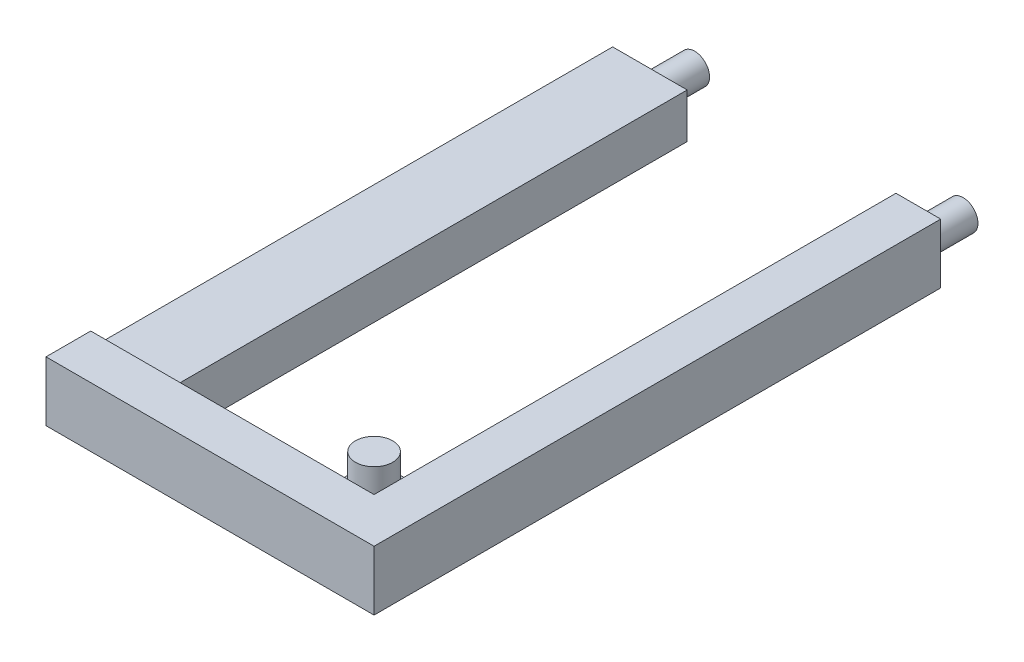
ISO-10303-21;
HEADER;
FILE_DESCRIPTION(('STEP AP214'),'2;1');
FILE_NAME('part.step','',(''),(''),'','','');
FILE_SCHEMA(('AUTOMOTIVE_DESIGN { 1 0 10303 214 1 1 1 1 }'));
ENDSEC;
DATA;
#1=APPLICATION_CONTEXT('core data for automotive mechanical design processes');
#2=APPLICATION_PROTOCOL_DEFINITION('international standard','automotive_design',2000,#1);
#3=PRODUCT_CONTEXT('',#1,'mechanical');
#4=PRODUCT('Part','Part','',(#3));
#5=PRODUCT_RELATED_PRODUCT_CATEGORY('part','',(#4));
#6=PRODUCT_DEFINITION_FORMATION('','',#4);
#7=PRODUCT_DEFINITION_CONTEXT('part definition',#1,'design');
#8=PRODUCT_DEFINITION('design','',#6,#7);
#9=PRODUCT_DEFINITION_SHAPE('','',#8);
#10=(LENGTH_UNIT() NAMED_UNIT(*) SI_UNIT(.MILLI.,.METRE.));
#11=(NAMED_UNIT(*) PLANE_ANGLE_UNIT() SI_UNIT($,.RADIAN.));
#12=(NAMED_UNIT(*) SI_UNIT($,.STERADIAN.) SOLID_ANGLE_UNIT());
#13=UNCERTAINTY_MEASURE_WITH_UNIT(LENGTH_MEASURE(1.E-05),#10,'distance_accuracy_value','');
#14=(GEOMETRIC_REPRESENTATION_CONTEXT(3) GLOBAL_UNCERTAINTY_ASSIGNED_CONTEXT((#13)) GLOBAL_UNIT_ASSIGNED_CONTEXT((#10,
#11,#12)) REPRESENTATION_CONTEXT('',''));
#15=CARTESIAN_POINT('',(0.,0.,0.));
#16=DIRECTION('',(0.,0.,1.));
#17=DIRECTION('',(1.,0.,0.));
#18=AXIS2_PLACEMENT_3D('',#15,#16,#17);
#19=CARTESIAN_POINT('',(2.5,3.,17.5));
#20=DIRECTION('',(-1.,0.,0.));
#21=DIRECTION('',(0.,0.,1.));
#22=AXIS2_PLACEMENT_3D('',#19,#20,#21);
#23=PLANE('',#22);
#24=DIRECTION('',(0.,0.,-1.));
#25=VECTOR('',#24,1.);
#26=CARTESIAN_POINT('',(2.5,0.,17.5));
#27=LINE('',#26,#25);
#28=CARTESIAN_POINT('',(2.5,0.,17.5));
#29=VERTEX_POINT('',#28);
#30=CARTESIAN_POINT('',(2.5,0.,-17.5));
#31=VERTEX_POINT('',#30);
#32=EDGE_CURVE('E108',#29,#31,#27,.T.);
#33=ORIENTED_EDGE('',*,*,#32,.T.);
#34=DIRECTION('',(0.,-1.,0.));
#35=VECTOR('',#34,1.);
#36=CARTESIAN_POINT('',(2.5,3.,-17.5));
#37=LINE('',#36,#35);
#38=CARTESIAN_POINT('',(2.5,3.,-17.5));
#39=VERTEX_POINT('',#38);
#40=EDGE_CURVE('E90',#39,#31,#37,.T.);
#41=ORIENTED_EDGE('',*,*,#40,.F.);
#42=DIRECTION('',(0.,0.,-1.));
#43=VECTOR('',#42,1.);
#44=CARTESIAN_POINT('',(2.5,3.,17.5));
#45=LINE('',#44,#43);
#46=CARTESIAN_POINT('',(2.5,3.,17.5));
#47=VERTEX_POINT('',#46);
#48=EDGE_CURVE('E99',#47,#39,#45,.T.);
#49=ORIENTED_EDGE('',*,*,#48,.F.);
#50=DIRECTION('',(0.,-1.,0.));
#51=VECTOR('',#50,1.);
#52=CARTESIAN_POINT('',(2.5,3.,17.5));
#53=LINE('',#52,#51);
#54=EDGE_CURVE('E60',#47,#29,#53,.T.);
#55=ORIENTED_EDGE('',*,*,#54,.T.);
#56=EDGE_LOOP('',(#33,#41,#49,#55));
#57=FACE_BOUND('',#56,.T.);
#58=ADVANCED_FACE('F43',(#57),#23,.F.);
#59=CARTESIAN_POINT('',(-2.5,3.,-17.5));
#60=DIRECTION('',(0.,0.,1.));
#61=DIRECTION('',(1.,0.,0.));
#62=AXIS2_PLACEMENT_3D('',#59,#60,#61);
#63=PLANE('',#62);
#64=CARTESIAN_POINT('',(0.,1.5,-17.5));
#65=DIRECTION('',(0.,0.,1.));
#66=DIRECTION('',(1.,0.,0.));
#67=AXIS2_PLACEMENT_3D('',#64,#65,#66);
#68=CIRCLE('',#67,1.);
#69=CARTESIAN_POINT('',(1.,1.5,-17.5));
#70=VERTEX_POINT('',#69);
#71=EDGE_CURVE('E11',#70,#70,#68,.F.);
#72=ORIENTED_EDGE('',*,*,#71,.F.);
#73=EDGE_LOOP('',(#72));
#74=FACE_BOUND('',#73,.T.);
#75=DIRECTION('',(-1.,0.,0.));
#76=VECTOR('',#75,1.);
#77=CARTESIAN_POINT('',(-2.5,0.,-17.5));
#78=LINE('',#77,#76);
#79=CARTESIAN_POINT('',(-2.5,0.,-17.5));
#80=VERTEX_POINT('',#79);
#81=EDGE_CURVE('E73',#31,#80,#78,.T.);
#82=ORIENTED_EDGE('',*,*,#81,.T.);
#83=DIRECTION('',(0.,-1.,0.));
#84=VECTOR('',#83,1.);
#85=CARTESIAN_POINT('',(-2.5,3.,-17.5));
#86=LINE('',#85,#84);
#87=CARTESIAN_POINT('',(-2.5,3.,-17.5));
#88=VERTEX_POINT('',#87);
#89=EDGE_CURVE('E93',#88,#80,#86,.T.);
#90=ORIENTED_EDGE('',*,*,#89,.F.);
#91=DIRECTION('',(-1.,0.,0.));
#92=VECTOR('',#91,1.);
#93=CARTESIAN_POINT('',(-2.5,3.,-17.5));
#94=LINE('',#93,#92);
#95=EDGE_CURVE('E86',#39,#88,#94,.T.);
#96=ORIENTED_EDGE('',*,*,#95,.F.);
#97=ORIENTED_EDGE('',*,*,#40,.T.);
#98=EDGE_LOOP('',(#82,#90,#96,#97));
#99=FACE_BOUND('',#98,.T.);
#100=ADVANCED_FACE('F88',(#74,#99),#63,.F.);
#101=CARTESIAN_POINT('',(-2.5,3.,17.5));
#102=DIRECTION('',(1.,0.,0.));
#103=DIRECTION('',(0.,0.,-1.));
#104=AXIS2_PLACEMENT_3D('',#101,#102,#103);
#105=PLANE('',#104);
#106=DIRECTION('',(0.,0.,1.));
#107=VECTOR('',#106,1.);
#108=CARTESIAN_POINT('',(-2.5,0.,17.5));
#109=LINE('',#108,#107);
#110=CARTESIAN_POINT('',(-2.5,0.,20.5));
#111=VERTEX_POINT('',#110);
#112=EDGE_CURVE('E106',#80,#111,#109,.T.);
#113=ORIENTED_EDGE('',*,*,#112,.T.);
#114=DIRECTION('',(0.,-1.,0.));
#115=VECTOR('',#114,1.);
#116=CARTESIAN_POINT('',(-2.5,0.,20.5));
#117=LINE('',#116,#115);
#118=CARTESIAN_POINT('',(-2.5,4.,20.5));
#119=VERTEX_POINT('',#118);
#120=EDGE_CURVE('E138',#119,#111,#117,.T.);
#121=ORIENTED_EDGE('',*,*,#120,.F.);
#122=DIRECTION('',(0.,0.,-1.));
#123=VECTOR('',#122,1.);
#124=CARTESIAN_POINT('',(-2.5,4.,20.5));
#125=LINE('',#124,#123);
#126=CARTESIAN_POINT('',(-2.5,4.,17.5));
#127=VERTEX_POINT('',#126);
#128=EDGE_CURVE('E125',#119,#127,#125,.T.);
#129=ORIENTED_EDGE('',*,*,#128,.T.);
#130=DIRECTION('',(0.,-1.,0.));
#131=VECTOR('',#130,1.);
#132=CARTESIAN_POINT('',(-2.5,0.,17.5));
#133=LINE('',#132,#131);
#134=CARTESIAN_POINT('',(-2.5,3.,17.5));
#135=VERTEX_POINT('',#134);
#136=EDGE_CURVE('E141',#127,#135,#133,.T.);
#137=ORIENTED_EDGE('',*,*,#136,.T.);
#138=DIRECTION('',(0.,0.,1.));
#139=VECTOR('',#138,1.);
#140=CARTESIAN_POINT('',(-2.5,3.,17.5));
#141=LINE('',#140,#139);
#142=EDGE_CURVE('E98',#88,#135,#141,.T.);
#143=ORIENTED_EDGE('',*,*,#142,.F.);
#144=ORIENTED_EDGE('',*,*,#89,.T.);
#145=EDGE_LOOP('',(#113,#121,#129,#137,#143,#144));
#146=FACE_BOUND('',#145,.T.);
#147=ADVANCED_FACE('F258',(#146),#105,.F.);
#148=CARTESIAN_POINT('',(0.,3.,0.));
#149=DIRECTION('',(0.,-1.,0.));
#150=DIRECTION('',(0.,0.,-1.));
#151=AXIS2_PLACEMENT_3D('',#148,#149,#150);
#152=PLANE('',#151);
#153=ORIENTED_EDGE('',*,*,#48,.T.);
#154=ORIENTED_EDGE('',*,*,#95,.T.);
#155=ORIENTED_EDGE('',*,*,#142,.T.);
#156=DIRECTION('',(1.,0.,0.));
#157=VECTOR('',#156,1.);
#158=CARTESIAN_POINT('',(-2.5,3.,17.5));
#159=LINE('',#158,#157);
#160=EDGE_CURVE('E103',#135,#47,#159,.T.);
#161=ORIENTED_EDGE('',*,*,#160,.T.);
#162=EDGE_LOOP('',(#153,#154,#155,#161));
#163=FACE_BOUND('',#162,.T.);
#164=ADVANCED_FACE('F102',(#163),#152,.F.);
#165=CARTESIAN_POINT('',(0.,0.,0.));
#166=DIRECTION('',(0.,-1.,0.));
#167=DIRECTION('',(0.,0.,-1.));
#168=AXIS2_PLACEMENT_3D('',#165,#166,#167);
#169=PLANE('',#168);
#170=ORIENTED_EDGE('',*,*,#32,.F.);
#171=DIRECTION('',(1.,0.,0.));
#172=VECTOR('',#171,1.);
#173=CARTESIAN_POINT('',(-2.5,0.,17.5));
#174=LINE('',#173,#172);
#175=CARTESIAN_POINT('',(11.5,0.,17.5));
#176=VERTEX_POINT('',#175);
#177=EDGE_CURVE('E79',#29,#176,#174,.T.);
#178=ORIENTED_EDGE('',*,*,#177,.T.);
#179=DIRECTION('',(0.,0.,1.));
#180=VECTOR('',#179,1.);
#181=CARTESIAN_POINT('',(11.5,0.,17.5));
#182=LINE('',#181,#180);
#183=CARTESIAN_POINT('',(11.5,0.,12.5));
#184=VERTEX_POINT('',#183);
#185=EDGE_CURVE('E161',#184,#176,#182,.T.);
#186=ORIENTED_EDGE('',*,*,#185,.F.);
#187=DIRECTION('',(-1.,0.,0.));
#188=VECTOR('',#187,1.);
#189=CARTESIAN_POINT('',(16.5,0.,12.5));
#190=LINE('',#189,#188);
#191=CARTESIAN_POINT('',(16.5,0.,12.5));
#192=VERTEX_POINT('',#191);
#193=EDGE_CURVE('E171',#192,#184,#190,.T.);
#194=ORIENTED_EDGE('',*,*,#193,.F.);
#195=DIRECTION('',(0.,0.,-1.));
#196=VECTOR('',#195,1.);
#197=CARTESIAN_POINT('',(16.5,0.,20.5));
#198=LINE('',#197,#196);
#199=CARTESIAN_POINT('',(16.5,0.,-17.5));
#200=VERTEX_POINT('',#199);
#201=EDGE_CURVE('E221',#192,#200,#198,.T.);
#202=ORIENTED_EDGE('',*,*,#201,.T.);
#203=DIRECTION('',(-1.,0.,0.));
#204=VECTOR('',#203,1.);
#205=CARTESIAN_POINT('',(19.5,0.,-17.5));
#206=LINE('',#205,#204);
#207=CARTESIAN_POINT('',(19.5,0.,-17.5));
#208=VERTEX_POINT('',#207);
#209=EDGE_CURVE('E200',#208,#200,#206,.T.);
#210=ORIENTED_EDGE('',*,*,#209,.F.);
#211=DIRECTION('',(0.,0.,-1.));
#212=VECTOR('',#211,1.);
#213=CARTESIAN_POINT('',(19.5,0.,20.5));
#214=LINE('',#213,#212);
#215=CARTESIAN_POINT('',(19.5,0.,20.5));
#216=VERTEX_POINT('',#215);
#217=EDGE_CURVE('E233',#216,#208,#214,.T.);
#218=ORIENTED_EDGE('',*,*,#217,.F.);
#219=DIRECTION('',(1.,0.,0.));
#220=VECTOR('',#219,1.);
#221=CARTESIAN_POINT('',(-2.5,0.,20.5));
#222=LINE('',#221,#220);
#223=EDGE_CURVE('E149',#111,#216,#222,.T.);
#224=ORIENTED_EDGE('',*,*,#223,.F.);
#225=ORIENTED_EDGE('',*,*,#112,.F.);
#226=ORIENTED_EDGE('',*,*,#81,.F.);
#227=EDGE_LOOP('',(#170,#178,#186,#194,#202,#210,#218,#224,#225,#226));
#228=FACE_BOUND('',#227,.T.);
#229=ADVANCED_FACE('F268',(#228),#169,.T.);
#230=CARTESIAN_POINT('',(0.,0.,17.5));
#231=DIRECTION('',(0.,0.,-1.));
#232=DIRECTION('',(-1.,0.,0.));
#233=AXIS2_PLACEMENT_3D('',#230,#231,#232);
#234=PLANE('',#233);
#235=DIRECTION('',(0.,1.,0.));
#236=VECTOR('',#235,1.);
#237=CARTESIAN_POINT('',(11.5,0.,17.5));
#238=LINE('',#237,#236);
#239=CARTESIAN_POINT('',(11.5,1.,17.5));
#240=VERTEX_POINT('',#239);
#241=EDGE_CURVE('E145',#176,#240,#238,.T.);
#242=ORIENTED_EDGE('',*,*,#241,.F.);
#243=ORIENTED_EDGE('',*,*,#177,.F.);
#244=ORIENTED_EDGE('',*,*,#54,.F.);
#245=ORIENTED_EDGE('',*,*,#160,.F.);
#246=ORIENTED_EDGE('',*,*,#136,.F.);
#247=DIRECTION('',(-1.,0.,0.));
#248=VECTOR('',#247,1.);
#249=CARTESIAN_POINT('',(-2.5,4.,17.5));
#250=LINE('',#249,#248);
#251=CARTESIAN_POINT('',(16.5,4.,17.5));
#252=VERTEX_POINT('',#251);
#253=EDGE_CURVE('E134',#252,#127,#250,.T.);
#254=ORIENTED_EDGE('',*,*,#253,.F.);
#255=DIRECTION('',(0.,1.,0.));
#256=VECTOR('',#255,1.);
#257=CARTESIAN_POINT('',(16.5,1.,17.5));
#258=LINE('',#257,#256);
#259=CARTESIAN_POINT('',(16.5,1.,17.5));
#260=VERTEX_POINT('',#259);
#261=EDGE_CURVE('E175',#260,#252,#258,.T.);
#262=ORIENTED_EDGE('',*,*,#261,.F.);
#263=DIRECTION('',(1.,0.,0.));
#264=VECTOR('',#263,1.);
#265=CARTESIAN_POINT('',(11.5,1.,17.5));
#266=LINE('',#265,#264);
#267=EDGE_CURVE('E187',#240,#260,#266,.T.);
#268=ORIENTED_EDGE('',*,*,#267,.F.);
#269=EDGE_LOOP('',(#242,#243,#244,#245,#246,#254,#262,#268));
#270=FACE_BOUND('',#269,.T.);
#271=ADVANCED_FACE('F271',(#270),#234,.T.);
#272=CARTESIAN_POINT('',(-2.5,4.,20.5));
#273=DIRECTION('',(0.,-1.,0.));
#274=DIRECTION('',(0.,0.,-1.));
#275=AXIS2_PLACEMENT_3D('',#272,#273,#274);
#276=PLANE('',#275);
#277=DIRECTION('',(-1.,0.,0.));
#278=VECTOR('',#277,1.);
#279=CARTESIAN_POINT('',(-2.5,4.,20.5));
#280=LINE('',#279,#278);
#281=CARTESIAN_POINT('',(19.5,4.,20.5));
#282=VERTEX_POINT('',#281);
#283=EDGE_CURVE('E133',#282,#119,#280,.T.);
#284=ORIENTED_EDGE('',*,*,#283,.F.);
#285=DIRECTION('',(0.,0.,1.));
#286=VECTOR('',#285,1.);
#287=CARTESIAN_POINT('',(19.5,4.,20.5));
#288=LINE('',#287,#286);
#289=CARTESIAN_POINT('',(19.5,4.,-17.5));
#290=VERTEX_POINT('',#289);
#291=EDGE_CURVE('E211',#290,#282,#288,.T.);
#292=ORIENTED_EDGE('',*,*,#291,.F.);
#293=DIRECTION('',(-1.,0.,0.));
#294=VECTOR('',#293,1.);
#295=CARTESIAN_POINT('',(19.5,4.,-17.5));
#296=LINE('',#295,#294);
#297=CARTESIAN_POINT('',(16.5,4.,-17.5));
#298=VERTEX_POINT('',#297);
#299=EDGE_CURVE('E207',#290,#298,#296,.T.);
#300=ORIENTED_EDGE('',*,*,#299,.T.);
#301=DIRECTION('',(0.,0.,1.));
#302=VECTOR('',#301,1.);
#303=CARTESIAN_POINT('',(16.5,4.,20.5));
#304=LINE('',#303,#302);
#305=EDGE_CURVE('E212',#298,#252,#304,.T.);
#306=ORIENTED_EDGE('',*,*,#305,.T.);
#307=ORIENTED_EDGE('',*,*,#253,.T.);
#308=ORIENTED_EDGE('',*,*,#128,.F.);
#309=EDGE_LOOP('',(#284,#292,#300,#306,#307,#308));
#310=FACE_BOUND('',#309,.T.);
#311=ADVANCED_FACE('F274',(#310),#276,.F.);
#312=CARTESIAN_POINT('',(0.,0.,20.5));
#313=DIRECTION('',(0.,0.,-1.));
#314=DIRECTION('',(-1.,0.,0.));
#315=AXIS2_PLACEMENT_3D('',#312,#313,#314);
#316=PLANE('',#315);
#317=ORIENTED_EDGE('',*,*,#120,.T.);
#318=ORIENTED_EDGE('',*,*,#223,.T.);
#319=DIRECTION('',(0.,-1.,0.));
#320=VECTOR('',#319,1.);
#321=CARTESIAN_POINT('',(19.5,0.,20.5));
#322=LINE('',#321,#320);
#323=EDGE_CURVE('E216',#282,#216,#322,.T.);
#324=ORIENTED_EDGE('',*,*,#323,.F.);
#325=ORIENTED_EDGE('',*,*,#283,.T.);
#326=EDGE_LOOP('',(#317,#318,#324,#325));
#327=FACE_BOUND('',#326,.T.);
#328=ADVANCED_FACE('F277',(#327),#316,.F.);
#329=CARTESIAN_POINT('',(11.5,0.,17.5));
#330=DIRECTION('',(-1.,0.,0.));
#331=DIRECTION('',(0.,0.,1.));
#332=AXIS2_PLACEMENT_3D('',#329,#330,#331);
#333=PLANE('',#332);
#334=DIRECTION('',(0.,0.,1.));
#335=VECTOR('',#334,1.);
#336=CARTESIAN_POINT('',(11.5,1.,17.5));
#337=LINE('',#336,#335);
#338=CARTESIAN_POINT('',(11.5,1.,12.5));
#339=VERTEX_POINT('',#338);
#340=EDGE_CURVE('E191',#339,#240,#337,.T.);
#341=ORIENTED_EDGE('',*,*,#340,.F.);
#342=DIRECTION('',(0.,1.,0.));
#343=VECTOR('',#342,1.);
#344=CARTESIAN_POINT('',(11.5,0.,12.5));
#345=LINE('',#344,#343);
#346=EDGE_CURVE('E160',#184,#339,#345,.T.);
#347=ORIENTED_EDGE('',*,*,#346,.F.);
#348=ORIENTED_EDGE('',*,*,#185,.T.);
#349=ORIENTED_EDGE('',*,*,#241,.T.);
#350=EDGE_LOOP('',(#341,#347,#348,#349));
#351=FACE_BOUND('',#350,.T.);
#352=ADVANCED_FACE('F284',(#351),#333,.T.);
#353=CARTESIAN_POINT('',(16.5,0.,12.5));
#354=DIRECTION('',(0.,0.,-1.));
#355=DIRECTION('',(-1.,0.,0.));
#356=AXIS2_PLACEMENT_3D('',#353,#354,#355);
#357=PLANE('',#356);
#358=DIRECTION('',(-1.,0.,0.));
#359=VECTOR('',#358,1.);
#360=CARTESIAN_POINT('',(11.5,1.,12.5));
#361=LINE('',#360,#359);
#362=CARTESIAN_POINT('',(16.5,1.,12.5));
#363=VERTEX_POINT('',#362);
#364=EDGE_CURVE('E179',#363,#339,#361,.T.);
#365=ORIENTED_EDGE('',*,*,#364,.F.);
#366=DIRECTION('',(0.,1.,0.));
#367=VECTOR('',#366,1.);
#368=CARTESIAN_POINT('',(16.5,0.,12.5));
#369=LINE('',#368,#367);
#370=EDGE_CURVE('E156',#192,#363,#369,.T.);
#371=ORIENTED_EDGE('',*,*,#370,.F.);
#372=ORIENTED_EDGE('',*,*,#193,.T.);
#373=ORIENTED_EDGE('',*,*,#346,.T.);
#374=EDGE_LOOP('',(#365,#371,#372,#373));
#375=FACE_BOUND('',#374,.T.);
#376=ADVANCED_FACE('F286',(#375),#357,.T.);
#377=CARTESIAN_POINT('',(0.,1.,0.));
#378=DIRECTION('',(0.,-1.,0.));
#379=DIRECTION('',(0.,0.,-1.));
#380=AXIS2_PLACEMENT_3D('',#377,#378,#379);
#381=PLANE('',#380);
#382=CARTESIAN_POINT('',(14.,1.,15.));
#383=DIRECTION('',(0.,1.,0.));
#384=DIRECTION('',(0.,0.,1.));
#385=AXIS2_PLACEMENT_3D('',#382,#383,#384);
#386=CIRCLE('',#385,1.25);
#387=CARTESIAN_POINT('',(14.,1.,16.25));
#388=VERTEX_POINT('',#387);
#389=EDGE_CURVE('E195',#388,#388,#386,.T.);
#390=ORIENTED_EDGE('',*,*,#389,.F.);
#391=EDGE_LOOP('',(#390));
#392=FACE_BOUND('',#391,.T.);
#393=ORIENTED_EDGE('',*,*,#340,.T.);
#394=ORIENTED_EDGE('',*,*,#267,.T.);
#395=DIRECTION('',(0.,0.,-1.));
#396=VECTOR('',#395,1.);
#397=CARTESIAN_POINT('',(16.5,1.,17.5));
#398=LINE('',#397,#396);
#399=EDGE_CURVE('E183',#260,#363,#398,.T.);
#400=ORIENTED_EDGE('',*,*,#399,.T.);
#401=ORIENTED_EDGE('',*,*,#364,.T.);
#402=EDGE_LOOP('',(#393,#394,#400,#401));
#403=FACE_BOUND('',#402,.T.);
#404=ADVANCED_FACE('F289',(#392,#403),#381,.F.);
#405=CARTESIAN_POINT('',(14.,1.,15.));
#406=DIRECTION('',(0.,1.,0.));
#407=DIRECTION('',(0.,0.,1.));
#408=AXIS2_PLACEMENT_3D('',#405,#406,#407);
#409=CYLINDRICAL_SURFACE('',#408,1.25);
#410=ORIENTED_EDGE('',*,*,#389,.T.);
#411=EDGE_LOOP('',(#410));
#412=FACE_BOUND('',#411,.T.);
#413=CARTESIAN_POINT('',(14.,4.,15.));
#414=DIRECTION('',(0.,1.,0.));
#415=DIRECTION('',(0.,0.,1.));
#416=AXIS2_PLACEMENT_3D('',#413,#414,#415);
#417=CIRCLE('',#416,1.25);
#418=CARTESIAN_POINT('',(14.,4.,16.25));
#419=VERTEX_POINT('',#418);
#420=EDGE_CURVE('E196',#419,#419,#417,.T.);
#421=ORIENTED_EDGE('',*,*,#420,.F.);
#422=EDGE_LOOP('',(#421));
#423=FACE_BOUND('',#422,.T.);
#424=ADVANCED_FACE('F296',(#412,#423),#409,.T.);
#425=ORIENTED_EDGE('',*,*,#420,.T.);
#426=EDGE_LOOP('',(#425));
#427=FACE_BOUND('',#426,.T.);
#428=ADVANCED_FACE('F279',(#427),#276,.F.);
#429=CARTESIAN_POINT('',(19.5,0.,-17.5));
#430=DIRECTION('',(0.,0.,1.));
#431=DIRECTION('',(1.,0.,0.));
#432=AXIS2_PLACEMENT_3D('',#429,#430,#431);
#433=PLANE('',#432);
#434=CARTESIAN_POINT('',(18.,2.,-17.5));
#435=DIRECTION('',(0.,0.,1.));
#436=DIRECTION('',(1.,0.,0.));
#437=AXIS2_PLACEMENT_3D('',#434,#435,#436);
#438=CIRCLE('',#437,1.);
#439=CARTESIAN_POINT('',(19.,2.,-17.5));
#440=VERTEX_POINT('',#439);
#441=EDGE_CURVE('E52',#440,#440,#438,.F.);
#442=ORIENTED_EDGE('',*,*,#441,.F.);
#443=EDGE_LOOP('',(#442));
#444=FACE_BOUND('',#443,.T.);
#445=DIRECTION('',(0.,1.,0.));
#446=VECTOR('',#445,1.);
#447=CARTESIAN_POINT('',(16.5,0.,-17.5));
#448=LINE('',#447,#446);
#449=EDGE_CURVE('E217',#200,#298,#448,.T.);
#450=ORIENTED_EDGE('',*,*,#449,.T.);
#451=ORIENTED_EDGE('',*,*,#299,.F.);
#452=DIRECTION('',(0.,1.,0.));
#453=VECTOR('',#452,1.);
#454=CARTESIAN_POINT('',(19.5,0.,-17.5));
#455=LINE('',#454,#453);
#456=EDGE_CURVE('E229',#208,#290,#455,.T.);
#457=ORIENTED_EDGE('',*,*,#456,.F.);
#458=ORIENTED_EDGE('',*,*,#209,.T.);
#459=EDGE_LOOP('',(#450,#451,#457,#458));
#460=FACE_BOUND('',#459,.T.);
#461=ADVANCED_FACE('F301',(#444,#460),#433,.F.);
#462=CARTESIAN_POINT('',(19.5,0.,0.));
#463=DIRECTION('',(-1.,0.,0.));
#464=DIRECTION('',(0.,0.,1.));
#465=AXIS2_PLACEMENT_3D('',#462,#463,#464);
#466=PLANE('',#465);
#467=ORIENTED_EDGE('',*,*,#323,.T.);
#468=ORIENTED_EDGE('',*,*,#217,.T.);
#469=ORIENTED_EDGE('',*,*,#456,.T.);
#470=ORIENTED_EDGE('',*,*,#291,.T.);
#471=EDGE_LOOP('',(#467,#468,#469,#470));
#472=FACE_BOUND('',#471,.T.);
#473=ADVANCED_FACE('F303',(#472),#466,.F.);
#474=CARTESIAN_POINT('',(16.5,0.,0.));
#475=DIRECTION('',(-1.,0.,0.));
#476=DIRECTION('',(0.,0.,1.));
#477=AXIS2_PLACEMENT_3D('',#474,#475,#476);
#478=PLANE('',#477);
#479=ORIENTED_EDGE('',*,*,#399,.F.);
#480=ORIENTED_EDGE('',*,*,#261,.T.);
#481=ORIENTED_EDGE('',*,*,#305,.F.);
#482=ORIENTED_EDGE('',*,*,#449,.F.);
#483=ORIENTED_EDGE('',*,*,#201,.F.);
#484=ORIENTED_EDGE('',*,*,#370,.T.);
#485=EDGE_LOOP('',(#479,#480,#481,#482,#483,#484));
#486=FACE_BOUND('',#485,.T.);
#487=ADVANCED_FACE('F305',(#486),#478,.T.);
#488=CARTESIAN_POINT('',(18.,2.,-20.5));
#489=DIRECTION('',(0.,0.,1.));
#490=DIRECTION('',(1.,0.,0.));
#491=AXIS2_PLACEMENT_3D('',#488,#489,#490);
#492=CYLINDRICAL_SURFACE('',#491,1.);
#493=CARTESIAN_POINT('',(18.,2.,-20.5));
#494=DIRECTION('',(0.,0.,-1.));
#495=DIRECTION('',(-1.,0.,0.));
#496=AXIS2_PLACEMENT_3D('',#493,#494,#495);
#497=CIRCLE('',#496,1.);
#498=CARTESIAN_POINT('',(17.,2.,-20.5));
#499=VERTEX_POINT('',#498);
#500=EDGE_CURVE('E225',#499,#499,#497,.T.);
#501=ORIENTED_EDGE('',*,*,#500,.F.);
#502=EDGE_LOOP('',(#501));
#503=FACE_BOUND('',#502,.T.);
#504=ORIENTED_EDGE('',*,*,#441,.T.);
#505=EDGE_LOOP('',(#504));
#506=FACE_BOUND('',#505,.T.);
#507=ADVANCED_FACE('F308',(#503,#506),#492,.T.);
#508=CARTESIAN_POINT('',(18.,2.,-20.5));
#509=DIRECTION('',(0.,0.,-1.));
#510=DIRECTION('',(-1.,0.,0.));
#511=AXIS2_PLACEMENT_3D('',#508,#509,#510);
#512=PLANE('',#511);
#513=ORIENTED_EDGE('',*,*,#500,.T.);
#514=EDGE_LOOP('',(#513));
#515=FACE_BOUND('',#514,.T.);
#516=ADVANCED_FACE('F253',(#515),#512,.T.);
#517=CARTESIAN_POINT('',(0.,1.5,-20.5));
#518=DIRECTION('',(0.,0.,1.));
#519=DIRECTION('',(1.,0.,0.));
#520=AXIS2_PLACEMENT_3D('',#517,#518,#519);
#521=CYLINDRICAL_SURFACE('',#520,1.);
#522=CARTESIAN_POINT('',(0.,1.5,-20.5));
#523=DIRECTION('',(0.,0.,-1.));
#524=DIRECTION('',(-1.,0.,0.));
#525=AXIS2_PLACEMENT_3D('',#522,#523,#524);
#526=CIRCLE('',#525,1.);
#527=CARTESIAN_POINT('',(-1.,1.5,-20.5));
#528=VERTEX_POINT('',#527);
#529=EDGE_CURVE('E243',#528,#528,#526,.T.);
#530=ORIENTED_EDGE('',*,*,#529,.F.);
#531=EDGE_LOOP('',(#530));
#532=FACE_BOUND('',#531,.T.);
#533=ORIENTED_EDGE('',*,*,#71,.T.);
#534=EDGE_LOOP('',(#533));
#535=FACE_BOUND('',#534,.T.);
#536=ADVANCED_FACE('F250',(#532,#535),#521,.T.);
#537=CARTESIAN_POINT('',(0.,1.5,-20.5));
#538=DIRECTION('',(0.,0.,-1.));
#539=DIRECTION('',(-1.,0.,0.));
#540=AXIS2_PLACEMENT_3D('',#537,#538,#539);
#541=PLANE('',#540);
#542=ORIENTED_EDGE('',*,*,#529,.T.);
#543=EDGE_LOOP('',(#542));
#544=FACE_BOUND('',#543,.T.);
#545=ADVANCED_FACE('F248',(#544),#541,.T.);
#546=CLOSED_SHELL('',(#58,#100,#147,#164,#229,#271,#311,#328,#352,#376,#404,#424,#428,#461,#473,
#487,#507,#516,#536,#545));
#547=MANIFOLD_SOLID_BREP('B2',#546);
#548=ADVANCED_BREP_SHAPE_REPRESENTATION('',(#18,#547),#14);
#549=SHAPE_DEFINITION_REPRESENTATION(#9,#548);
ENDSEC;
END-ISO-10303-21;
